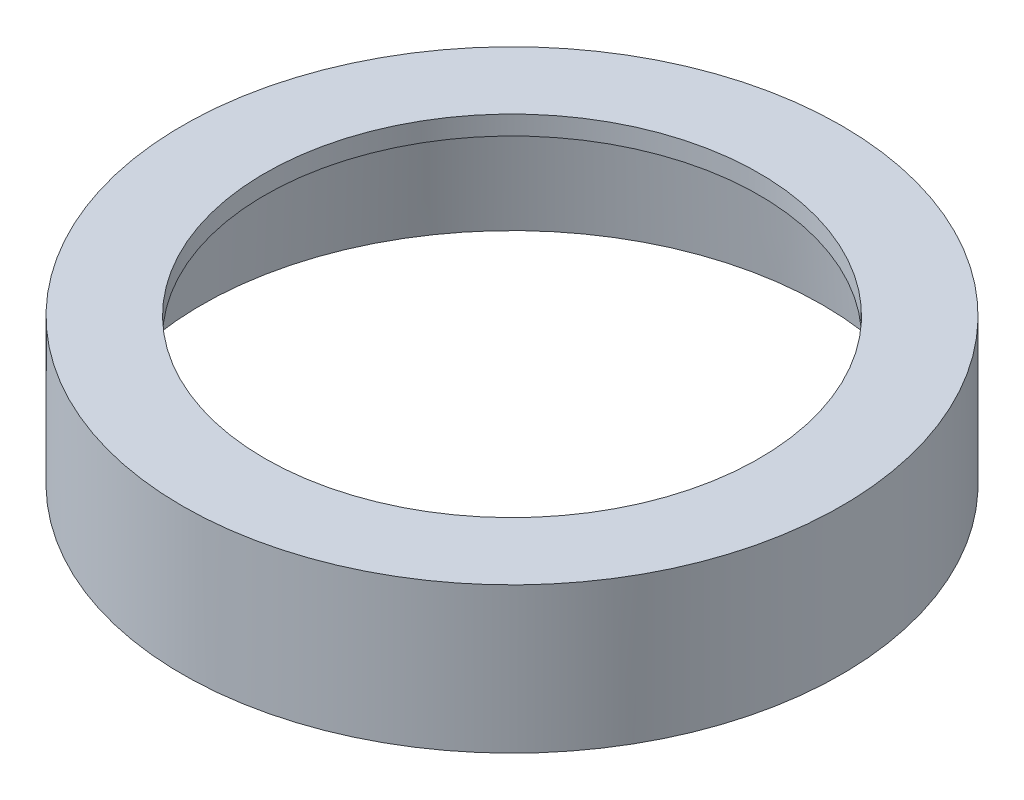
ISO-10303-21;
HEADER;
FILE_DESCRIPTION(('STEP AP214'),'2;1');
FILE_NAME('part.step','',(''),(''),'','','');
FILE_SCHEMA(('AUTOMOTIVE_DESIGN { 1 0 10303 214 1 1 1 1 }'));
ENDSEC;
DATA;
#1=APPLICATION_CONTEXT('core data for automotive mechanical design processes');
#2=APPLICATION_PROTOCOL_DEFINITION('international standard','automotive_design',2000,#1);
#3=PRODUCT_CONTEXT('',#1,'mechanical');
#4=PRODUCT('Part','Part','',(#3));
#5=PRODUCT_RELATED_PRODUCT_CATEGORY('part','',(#4));
#6=PRODUCT_DEFINITION_FORMATION('','',#4);
#7=PRODUCT_DEFINITION_CONTEXT('part definition',#1,'design');
#8=PRODUCT_DEFINITION('design','',#6,#7);
#9=PRODUCT_DEFINITION_SHAPE('','',#8);
#10=(LENGTH_UNIT() NAMED_UNIT(*) SI_UNIT(.MILLI.,.METRE.));
#11=(NAMED_UNIT(*) PLANE_ANGLE_UNIT() SI_UNIT($,.RADIAN.));
#12=(NAMED_UNIT(*) SI_UNIT($,.STERADIAN.) SOLID_ANGLE_UNIT());
#13=UNCERTAINTY_MEASURE_WITH_UNIT(LENGTH_MEASURE(1.E-05),#10,'distance_accuracy_value','');
#14=(GEOMETRIC_REPRESENTATION_CONTEXT(3) GLOBAL_UNCERTAINTY_ASSIGNED_CONTEXT((#13)) GLOBAL_UNIT_ASSIGNED_CONTEXT((#10,
#11,#12)) REPRESENTATION_CONTEXT('',''));
#15=CARTESIAN_POINT('',(0.,0.,0.));
#16=DIRECTION('',(0.,0.,1.));
#17=DIRECTION('',(1.,0.,0.));
#18=AXIS2_PLACEMENT_3D('',#15,#16,#17);
#19=CARTESIAN_POINT('',(0.,1.5,0.));
#20=DIRECTION('',(0.,1.,0.));
#21=DIRECTION('',(0.,0.,1.));
#22=AXIS2_PLACEMENT_3D('',#19,#20,#21);
#23=PLANE('',#22);
#24=CARTESIAN_POINT('',(0.,1.5,0.));
#25=DIRECTION('',(0.,1.,0.));
#26=DIRECTION('',(0.,0.,1.));
#27=AXIS2_PLACEMENT_3D('',#24,#25,#26);
#28=CIRCLE('',#27,26.);
#29=CARTESIAN_POINT('',(0.,1.5,26.));
#30=VERTEX_POINT('',#29);
#31=EDGE_CURVE('E11',#30,#30,#28,.T.);
#32=ORIENTED_EDGE('',*,*,#31,.T.);
#33=EDGE_LOOP('',(#32));
#34=FACE_BOUND('',#33,.T.);
#35=CARTESIAN_POINT('',(0.,1.5,0.));
#36=DIRECTION('',(0.,1.,0.));
#37=DIRECTION('',(0.,0.,1.));
#38=AXIS2_PLACEMENT_3D('',#35,#36,#37);
#39=CIRCLE('',#38,19.5);
#40=CARTESIAN_POINT('',(0.,1.5,19.5));
#41=VERTEX_POINT('',#40);
#42=EDGE_CURVE('E44',#41,#41,#39,.T.);
#43=ORIENTED_EDGE('',*,*,#42,.F.);
#44=EDGE_LOOP('',(#43));
#45=FACE_BOUND('',#44,.T.);
#46=ADVANCED_FACE('F37',(#34,#45),#23,.T.);
#47=CARTESIAN_POINT('',(0.,0.,0.));
#48=DIRECTION('',(0.,1.,0.));
#49=DIRECTION('',(0.,0.,1.));
#50=AXIS2_PLACEMENT_3D('',#47,#48,#49);
#51=PLANE('',#50);
#52=CARTESIAN_POINT('',(0.,0.,0.));
#53=DIRECTION('',(0.,-1.,0.));
#54=DIRECTION('',(0.,0.,-1.));
#55=AXIS2_PLACEMENT_3D('',#52,#53,#54);
#56=CIRCLE('',#55,23.75);
#57=CARTESIAN_POINT('',(0.,0.,-23.75));
#58=VERTEX_POINT('',#57);
#59=EDGE_CURVE('E57',#58,#58,#56,.T.);
#60=ORIENTED_EDGE('',*,*,#59,.T.);
#61=EDGE_LOOP('',(#60));
#62=FACE_BOUND('',#61,.T.);
#63=CARTESIAN_POINT('',(0.,0.,0.));
#64=DIRECTION('',(0.,1.,0.));
#65=DIRECTION('',(0.,0.,1.));
#66=AXIS2_PLACEMENT_3D('',#63,#64,#65);
#67=CIRCLE('',#66,19.5);
#68=CARTESIAN_POINT('',(0.,0.,19.5));
#69=VERTEX_POINT('',#68);
#70=EDGE_CURVE('E48',#69,#69,#67,.T.);
#71=ORIENTED_EDGE('',*,*,#70,.T.);
#72=EDGE_LOOP('',(#71));
#73=FACE_BOUND('',#72,.T.);
#74=ADVANCED_FACE('F75',(#62,#73),#51,.F.);
#75=CARTESIAN_POINT('',(0.,1.5,0.));
#76=DIRECTION('',(0.,-1.,0.));
#77=DIRECTION('',(0.,0.,-1.));
#78=AXIS2_PLACEMENT_3D('',#75,#76,#77);
#79=CYLINDRICAL_SURFACE('',#78,26.);
#80=ORIENTED_EDGE('',*,*,#31,.F.);
#81=EDGE_LOOP('',(#80));
#82=FACE_BOUND('',#81,.T.);
#83=CARTESIAN_POINT('',(0.,-10.,0.));
#84=DIRECTION('',(0.,-1.,0.));
#85=DIRECTION('',(0.,0.,-1.));
#86=AXIS2_PLACEMENT_3D('',#83,#84,#85);
#87=CIRCLE('',#86,26.);
#88=CARTESIAN_POINT('',(0.,-10.,-26.));
#89=VERTEX_POINT('',#88);
#90=EDGE_CURVE('E53',#89,#89,#87,.T.);
#91=ORIENTED_EDGE('',*,*,#90,.F.);
#92=EDGE_LOOP('',(#91));
#93=FACE_BOUND('',#92,.T.);
#94=ADVANCED_FACE('F39',(#82,#93),#79,.T.);
#95=CARTESIAN_POINT('',(0.,1.5,0.));
#96=DIRECTION('',(0.,-1.,0.));
#97=DIRECTION('',(0.,0.,-1.));
#98=AXIS2_PLACEMENT_3D('',#95,#96,#97);
#99=CYLINDRICAL_SURFACE('',#98,19.5);
#100=ORIENTED_EDGE('',*,*,#42,.T.);
#101=EDGE_LOOP('',(#100));
#102=FACE_BOUND('',#101,.T.);
#103=ORIENTED_EDGE('',*,*,#70,.F.);
#104=EDGE_LOOP('',(#103));
#105=FACE_BOUND('',#104,.T.);
#106=ADVANCED_FACE('F70',(#102,#105),#99,.F.);
#107=CARTESIAN_POINT('',(0.,-10.,0.));
#108=DIRECTION('',(0.,-1.,0.));
#109=DIRECTION('',(0.,0.,-1.));
#110=AXIS2_PLACEMENT_3D('',#107,#108,#109);
#111=PLANE('',#110);
#112=CARTESIAN_POINT('',(0.,-10.,0.));
#113=DIRECTION('',(0.,-1.,0.));
#114=DIRECTION('',(0.,0.,-1.));
#115=AXIS2_PLACEMENT_3D('',#112,#113,#114);
#116=CIRCLE('',#115,24.5);
#117=CARTESIAN_POINT('',(0.,-10.,-24.5));
#118=VERTEX_POINT('',#117);
#119=EDGE_CURVE('E60',#118,#118,#116,.T.);
#120=ORIENTED_EDGE('',*,*,#119,.F.);
#121=EDGE_LOOP('',(#120));
#122=FACE_BOUND('',#121,.T.);
#123=ORIENTED_EDGE('',*,*,#90,.T.);
#124=EDGE_LOOP('',(#123));
#125=FACE_BOUND('',#124,.T.);
#126=ADVANCED_FACE('F67',(#122,#125),#111,.T.);
#127=CARTESIAN_POINT('',(0.,0.,0.));
#128=DIRECTION('',(0.,-1.,0.));
#129=DIRECTION('',(0.,0.,-1.));
#130=AXIS2_PLACEMENT_3D('',#127,#128,#129);
#131=CONICAL_SURFACE('',#130,23.75,0.0748598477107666);
#132=ORIENTED_EDGE('',*,*,#119,.T.);
#133=EDGE_LOOP('',(#132));
#134=FACE_BOUND('',#133,.T.);
#135=ORIENTED_EDGE('',*,*,#59,.F.);
#136=EDGE_LOOP('',(#135));
#137=FACE_BOUND('',#136,.T.);
#138=ADVANCED_FACE('F64',(#134,#137),#131,.F.);
#139=CLOSED_SHELL('',(#46,#74,#94,#106,#126,#138));
#140=MANIFOLD_SOLID_BREP('B2',#139);
#141=ADVANCED_BREP_SHAPE_REPRESENTATION('',(#18,#140),#14);
#142=SHAPE_DEFINITION_REPRESENTATION(#9,#141);
ENDSEC;
END-ISO-10303-21;
